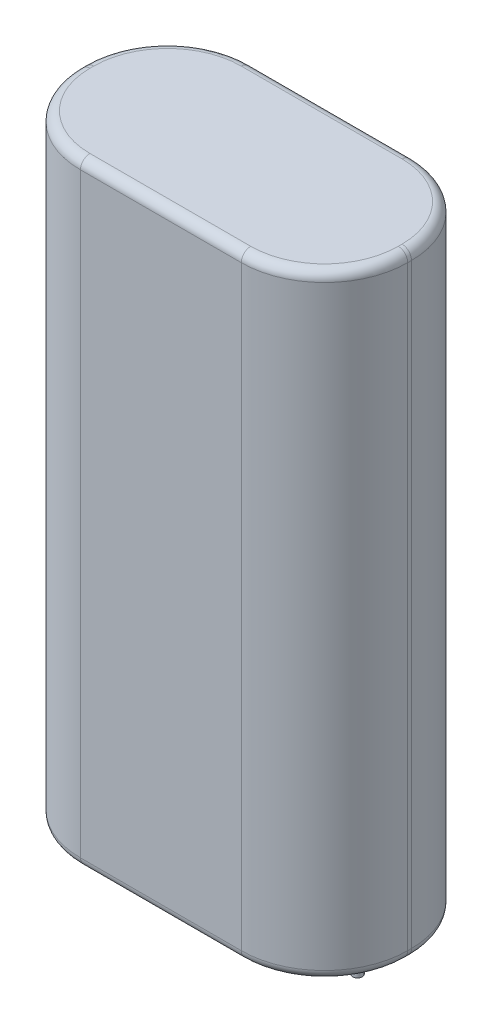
ISO-10303-21;
HEADER;
FILE_DESCRIPTION(('STEP AP214'),'2;1');
FILE_NAME('part.step','',(''),(''),'','','');
FILE_SCHEMA(('AUTOMOTIVE_DESIGN { 1 0 10303 214 1 1 1 1 }'));
ENDSEC;
DATA;
#1=APPLICATION_CONTEXT('core data for automotive mechanical design processes');
#2=APPLICATION_PROTOCOL_DEFINITION('international standard','automotive_design',2000,#1);
#3=PRODUCT_CONTEXT('',#1,'mechanical');
#4=PRODUCT('Part','Part','',(#3));
#5=PRODUCT_RELATED_PRODUCT_CATEGORY('part','',(#4));
#6=PRODUCT_DEFINITION_FORMATION('','',#4);
#7=PRODUCT_DEFINITION_CONTEXT('part definition',#1,'design');
#8=PRODUCT_DEFINITION('design','',#6,#7);
#9=PRODUCT_DEFINITION_SHAPE('','',#8);
#10=(LENGTH_UNIT() NAMED_UNIT(*) SI_UNIT(.MILLI.,.METRE.));
#11=(NAMED_UNIT(*) PLANE_ANGLE_UNIT() SI_UNIT($,.RADIAN.));
#12=(NAMED_UNIT(*) SI_UNIT($,.STERADIAN.) SOLID_ANGLE_UNIT());
#13=UNCERTAINTY_MEASURE_WITH_UNIT(LENGTH_MEASURE(1.E-05),#10,'distance_accuracy_value','');
#14=(GEOMETRIC_REPRESENTATION_CONTEXT(3) GLOBAL_UNCERTAINTY_ASSIGNED_CONTEXT((#13)) GLOBAL_UNIT_ASSIGNED_CONTEXT((#10,
#11,#12)) REPRESENTATION_CONTEXT('',''));
#15=CARTESIAN_POINT('',(0.,0.,0.));
#16=DIRECTION('',(0.,0.,1.));
#17=DIRECTION('',(1.,0.,0.));
#18=AXIS2_PLACEMENT_3D('',#15,#16,#17);
#19=CARTESIAN_POINT('',(5.9,-2.,0.));
#20=DIRECTION('',(0.,-1.,0.));
#21=DIRECTION('',(0.,0.,-1.));
#22=AXIS2_PLACEMENT_3D('',#19,#20,#21);
#23=PLANE('',#22);
#24=CARTESIAN_POINT('',(5.9,-2.,0.));
#25=DIRECTION('',(0.,1.,0.));
#26=DIRECTION('',(0.,0.,1.));
#27=AXIS2_PLACEMENT_3D('',#24,#25,#26);
#28=CIRCLE('',#27,0.25);
#29=CARTESIAN_POINT('',(5.9,-2.,0.25));
#30=VERTEX_POINT('',#29);
#31=EDGE_CURVE('E20',#30,#30,#28,.T.);
#32=ORIENTED_EDGE('',*,*,#31,.F.);
#33=EDGE_LOOP('',(#32));
#34=FACE_BOUND('',#33,.T.);
#35=ADVANCED_FACE('F17',(#34),#23,.T.);
#36=CARTESIAN_POINT('',(-5.9,-2.,0.));
#37=DIRECTION('',(0.,-1.,0.));
#38=DIRECTION('',(0.,0.,-1.));
#39=AXIS2_PLACEMENT_3D('',#36,#37,#38);
#40=PLANE('',#39);
#41=CARTESIAN_POINT('',(-5.9,-2.,0.));
#42=DIRECTION('',(0.,1.,0.));
#43=DIRECTION('',(0.,0.,1.));
#44=AXIS2_PLACEMENT_3D('',#41,#42,#43);
#45=CIRCLE('',#44,0.25);
#46=CARTESIAN_POINT('',(-5.9,-2.,0.25));
#47=VERTEX_POINT('',#46);
#48=EDGE_CURVE('E172',#47,#47,#45,.T.);
#49=ORIENTED_EDGE('',*,*,#48,.F.);
#50=EDGE_LOOP('',(#49));
#51=FACE_BOUND('',#50,.T.);
#52=ADVANCED_FACE('F647',(#51),#40,.T.);
#53=CARTESIAN_POINT('',(-4.25,32.5,-4.5));
#54=DIRECTION('',(0.,0.,1.));
#55=DIRECTION('',(1.,0.,0.));
#56=AXIS2_PLACEMENT_3D('',#53,#54,#55);
#57=PLANE('',#56);
#58=DIRECTION('',(-1.,0.,0.));
#59=VECTOR('',#58,1.);
#60=CARTESIAN_POINT('',(-4.25,0.500000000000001,-4.5));
#61=LINE('',#60,#59);
#62=CARTESIAN_POINT('',(-4.25,0.5,-4.5));
#63=VERTEX_POINT('',#62);
#64=CARTESIAN_POINT('',(4.25,0.5,-4.5));
#65=VERTEX_POINT('',#64);
#66=EDGE_CURVE('E182',#63,#65,#61,.F.);
#67=ORIENTED_EDGE('',*,*,#66,.F.);
#68=DIRECTION('',(0.,-1.,0.));
#69=VECTOR('',#68,1.);
#70=CARTESIAN_POINT('',(-4.25,32.5,-4.5));
#71=LINE('',#70,#69);
#72=CARTESIAN_POINT('',(-4.25,32.,-4.5));
#73=VERTEX_POINT('',#72);
#74=EDGE_CURVE('E157',#73,#63,#71,.T.);
#75=ORIENTED_EDGE('',*,*,#74,.F.);
#76=DIRECTION('',(1.,0.,0.));
#77=VECTOR('',#76,1.);
#78=CARTESIAN_POINT('',(4.25,32.,-4.5));
#79=LINE('',#78,#77);
#80=CARTESIAN_POINT('',(4.25,32.,-4.5));
#81=VERTEX_POINT('',#80);
#82=EDGE_CURVE('E131',#81,#73,#79,.F.);
#83=ORIENTED_EDGE('',*,*,#82,.F.);
#84=DIRECTION('',(0.,-1.,0.));
#85=VECTOR('',#84,1.);
#86=CARTESIAN_POINT('',(4.25,32.5,-4.5));
#87=LINE('',#86,#85);
#88=EDGE_CURVE('E145',#65,#81,#87,.F.);
#89=ORIENTED_EDGE('',*,*,#88,.F.);
#90=EDGE_LOOP('',(#67,#75,#83,#89));
#91=FACE_BOUND('',#90,.T.);
#92=ADVANCED_FACE('F155',(#91),#57,.F.);
#93=CARTESIAN_POINT('',(4.25,32.,-0.1));
#94=DIRECTION('',(0.,1.,0.));
#95=DIRECTION('',(0.,0.,1.));
#96=AXIS2_PLACEMENT_3D('',#93,#94,#95);
#97=TOROIDAL_SURFACE('',#96,3.9,0.5);
#98=CARTESIAN_POINT('',(4.25,32.,-4.));
#99=DIRECTION('',(1.,0.,0.));
#100=DIRECTION('',(0.,0.,-1.));
#101=AXIS2_PLACEMENT_3D('',#98,#99,#100);
#102=CIRCLE('',#101,0.5);
#103=CARTESIAN_POINT('',(4.25,32.5,-4.));
#104=VERTEX_POINT('',#103);
#105=EDGE_CURVE('E126',#104,#81,#102,.F.);
#106=ORIENTED_EDGE('',*,*,#105,.F.);
#107=CARTESIAN_POINT('',(4.25,32.5,-0.1));
#108=DIRECTION('',(0.,-1.,0.));
#109=DIRECTION('',(0.,0.,-1.));
#110=AXIS2_PLACEMENT_3D('',#107,#108,#109);
#111=CIRCLE('',#110,3.9);
#112=CARTESIAN_POINT('',(8.15,32.5,-0.100000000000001));
#113=VERTEX_POINT('',#112);
#114=EDGE_CURVE('E289',#113,#104,#111,.F.);
#115=ORIENTED_EDGE('',*,*,#114,.F.);
#116=CARTESIAN_POINT('',(8.15,32.,-0.100000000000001));
#117=DIRECTION('',(0.,0.,1.));
#118=DIRECTION('',(1.,0.,0.));
#119=AXIS2_PLACEMENT_3D('',#116,#117,#118);
#120=CIRCLE('',#119,0.5);
#121=CARTESIAN_POINT('',(8.65,32.,-0.100000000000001));
#122=VERTEX_POINT('',#121);
#123=EDGE_CURVE('E141',#122,#113,#120,.T.);
#124=ORIENTED_EDGE('',*,*,#123,.F.);
#125=CARTESIAN_POINT('',(4.25,32.,-0.1));
#126=DIRECTION('',(0.,-1.,0.));
#127=DIRECTION('',(0.,0.,-1.));
#128=AXIS2_PLACEMENT_3D('',#125,#126,#127);
#129=CIRCLE('',#128,4.4);
#130=EDGE_CURVE('E138',#81,#122,#129,.T.);
#131=ORIENTED_EDGE('',*,*,#130,.F.);
#132=EDGE_LOOP('',(#106,#115,#124,#131));
#133=FACE_BOUND('',#132,.T.);
#134=ADVANCED_FACE('F140',(#133),#97,.T.);
#135=CARTESIAN_POINT('',(4.25,32.,-4.));
#136=DIRECTION('',(1.,0.,0.));
#137=DIRECTION('',(0.,0.,-1.));
#138=AXIS2_PLACEMENT_3D('',#135,#136,#137);
#139=CYLINDRICAL_SURFACE('',#138,0.5);
#140=CARTESIAN_POINT('',(-4.25,32.,-4.));
#141=DIRECTION('',(-1.,0.,0.));
#142=DIRECTION('',(0.,0.,-1.));
#143=AXIS2_PLACEMENT_3D('',#140,#141,#142);
#144=CIRCLE('',#143,0.5);
#145=CARTESIAN_POINT('',(-4.25,32.5,-4.));
#146=VERTEX_POINT('',#145);
#147=EDGE_CURVE('E152',#146,#73,#144,.T.);
#148=ORIENTED_EDGE('',*,*,#147,.F.);
#149=DIRECTION('',(1.,0.,0.));
#150=VECTOR('',#149,1.);
#151=CARTESIAN_POINT('',(4.25,32.5,-4.));
#152=LINE('',#151,#150);
#153=EDGE_CURVE('E133',#104,#146,#152,.F.);
#154=ORIENTED_EDGE('',*,*,#153,.F.);
#155=ORIENTED_EDGE('',*,*,#105,.T.);
#156=ORIENTED_EDGE('',*,*,#82,.T.);
#157=EDGE_LOOP('',(#148,#154,#155,#156));
#158=FACE_BOUND('',#157,.T.);
#159=ADVANCED_FACE('F129',(#158),#139,.T.);
#160=CARTESIAN_POINT('',(-4.25,32.,-0.1));
#161=DIRECTION('',(0.,1.,0.));
#162=DIRECTION('',(0.,0.,1.));
#163=AXIS2_PLACEMENT_3D('',#160,#161,#162);
#164=TOROIDAL_SURFACE('',#163,3.9,0.5);
#165=CARTESIAN_POINT('',(-8.15,32.,-0.0999999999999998));
#166=DIRECTION('',(0.,0.,-1.));
#167=DIRECTION('',(-1.,0.,0.));
#168=AXIS2_PLACEMENT_3D('',#165,#166,#167);
#169=CIRCLE('',#168,0.5);
#170=CARTESIAN_POINT('',(-8.15,32.5,-0.1));
#171=VERTEX_POINT('',#170);
#172=CARTESIAN_POINT('',(-8.65,32.,-0.0999999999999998));
#173=VERTEX_POINT('',#172);
#174=EDGE_CURVE('E320',#171,#173,#169,.F.);
#175=ORIENTED_EDGE('',*,*,#174,.F.);
#176=CARTESIAN_POINT('',(-4.25,32.5,-0.1));
#177=DIRECTION('',(0.,-1.,0.));
#178=DIRECTION('',(-1.,0.,0.));
#179=AXIS2_PLACEMENT_3D('',#176,#177,#178);
#180=CIRCLE('',#179,3.9);
#181=EDGE_CURVE('E301',#146,#171,#180,.F.);
#182=ORIENTED_EDGE('',*,*,#181,.F.);
#183=ORIENTED_EDGE('',*,*,#147,.T.);
#184=CARTESIAN_POINT('',(-4.25,32.,-0.1));
#185=DIRECTION('',(0.,-1.,0.));
#186=DIRECTION('',(0.,0.,-1.));
#187=AXIS2_PLACEMENT_3D('',#184,#185,#186);
#188=CIRCLE('',#187,4.4);
#189=EDGE_CURVE('E698',#173,#73,#188,.T.);
#190=ORIENTED_EDGE('',*,*,#189,.F.);
#191=EDGE_LOOP('',(#175,#182,#183,#190));
#192=FACE_BOUND('',#191,.T.);
#193=ADVANCED_FACE('F621',(#192),#164,.T.);
#194=CARTESIAN_POINT('',(4.25,32.5,-0.1));
#195=DIRECTION('',(0.,-1.,0.));
#196=DIRECTION('',(0.,0.,-1.));
#197=AXIS2_PLACEMENT_3D('',#194,#195,#196);
#198=CYLINDRICAL_SURFACE('',#197,4.4);
#199=ORIENTED_EDGE('',*,*,#88,.T.);
#200=ORIENTED_EDGE('',*,*,#130,.T.);
#201=DIRECTION('',(0.,1.,0.));
#202=VECTOR('',#201,1.);
#203=CARTESIAN_POINT('',(8.65,32.5,-0.100000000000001));
#204=LINE('',#203,#202);
#205=CARTESIAN_POINT('',(8.65,0.5,-0.100000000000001));
#206=VERTEX_POINT('',#205);
#207=EDGE_CURVE('E684',#122,#206,#204,.F.);
#208=ORIENTED_EDGE('',*,*,#207,.T.);
#209=CARTESIAN_POINT('',(4.25,0.5,-0.1));
#210=DIRECTION('',(0.,1.,0.));
#211=DIRECTION('',(0.,0.,1.));
#212=AXIS2_PLACEMENT_3D('',#209,#210,#211);
#213=CIRCLE('',#212,4.4);
#214=EDGE_CURVE('E149',#65,#206,#213,.F.);
#215=ORIENTED_EDGE('',*,*,#214,.F.);
#216=EDGE_LOOP('',(#199,#200,#208,#215));
#217=FACE_BOUND('',#216,.T.);
#218=ADVANCED_FACE('F148',(#217),#198,.T.);
#219=CARTESIAN_POINT('',(8.15,32.,0.0999999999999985));
#220=DIRECTION('',(0.,0.,1.));
#221=DIRECTION('',(1.,0.,0.));
#222=AXIS2_PLACEMENT_3D('',#219,#220,#221);
#223=CYLINDRICAL_SURFACE('',#222,0.5);
#224=CARTESIAN_POINT('',(8.15,32.,0.0999999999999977));
#225=DIRECTION('',(0.,0.,-1.));
#226=DIRECTION('',(1.,0.,0.));
#227=AXIS2_PLACEMENT_3D('',#224,#225,#226);
#228=CIRCLE('',#227,0.5);
#229=CARTESIAN_POINT('',(8.65,32.,0.0999999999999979));
#230=VERTEX_POINT('',#229);
#231=CARTESIAN_POINT('',(8.15,32.5,0.0999999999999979));
#232=VERTEX_POINT('',#231);
#233=EDGE_CURVE('E690',#230,#232,#228,.F.);
#234=ORIENTED_EDGE('',*,*,#233,.F.);
#235=DIRECTION('',(0.,0.,1.));
#236=VECTOR('',#235,1.);
#237=CARTESIAN_POINT('',(8.65,32.,-0.100000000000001));
#238=LINE('',#237,#236);
#239=EDGE_CURVE('E688',#230,#122,#238,.F.);
#240=ORIENTED_EDGE('',*,*,#239,.T.);
#241=ORIENTED_EDGE('',*,*,#123,.T.);
#242=DIRECTION('',(0.,0.,1.));
#243=VECTOR('',#242,1.);
#244=CARTESIAN_POINT('',(8.15,32.5,0.0999999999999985));
#245=LINE('',#244,#243);
#246=EDGE_CURVE('E314',#232,#113,#245,.F.);
#247=ORIENTED_EDGE('',*,*,#246,.F.);
#248=EDGE_LOOP('',(#234,#240,#241,#247));
#249=FACE_BOUND('',#248,.T.);
#250=ADVANCED_FACE('F608',(#249),#223,.T.);
#251=CARTESIAN_POINT('',(8.15,0.5,-0.100000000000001));
#252=DIRECTION('',(0.,0.,-1.));
#253=DIRECTION('',(-1.,0.,0.));
#254=AXIS2_PLACEMENT_3D('',#251,#252,#253);
#255=CYLINDRICAL_SURFACE('',#254,0.5);
#256=CARTESIAN_POINT('',(8.15,0.5,0.0999999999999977));
#257=DIRECTION('',(0.,0.,-1.));
#258=DIRECTION('',(1.,0.,0.));
#259=AXIS2_PLACEMENT_3D('',#256,#257,#258);
#260=CIRCLE('',#259,0.5);
#261=CARTESIAN_POINT('',(8.15,0.,0.0999999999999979));
#262=VERTEX_POINT('',#261);
#263=CARTESIAN_POINT('',(8.65,0.5,0.099999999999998));
#264=VERTEX_POINT('',#263);
#265=EDGE_CURVE('E692',#262,#264,#260,.F.);
#266=ORIENTED_EDGE('',*,*,#265,.F.);
#267=DIRECTION('',(0.,0.,1.));
#268=VECTOR('',#267,1.);
#269=CARTESIAN_POINT('',(8.15,0.,0.0999999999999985));
#270=LINE('',#269,#268);
#271=CARTESIAN_POINT('',(8.15,0.,-0.100000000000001));
#272=VERTEX_POINT('',#271);
#273=EDGE_CURVE('E445',#262,#272,#270,.F.);
#274=ORIENTED_EDGE('',*,*,#273,.T.);
#275=CARTESIAN_POINT('',(8.15,0.5,-0.100000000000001));
#276=DIRECTION('',(0.,0.,-1.));
#277=DIRECTION('',(1.,0.,0.));
#278=AXIS2_PLACEMENT_3D('',#275,#276,#277);
#279=CIRCLE('',#278,0.5);
#280=EDGE_CURVE('E219',#206,#272,#279,.T.);
#281=ORIENTED_EDGE('',*,*,#280,.F.);
#282=DIRECTION('',(0.,0.,1.));
#283=VECTOR('',#282,1.);
#284=CARTESIAN_POINT('',(8.65,0.5,-0.100000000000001));
#285=LINE('',#284,#283);
#286=EDGE_CURVE('E687',#206,#264,#285,.T.);
#287=ORIENTED_EDGE('',*,*,#286,.T.);
#288=EDGE_LOOP('',(#266,#274,#281,#287));
#289=FACE_BOUND('',#288,.T.);
#290=ADVANCED_FACE('F213',(#289),#255,.T.);
#291=CARTESIAN_POINT('',(4.25,0.5,-0.1));
#292=DIRECTION('',(0.,1.,0.));
#293=DIRECTION('',(0.,0.,1.));
#294=AXIS2_PLACEMENT_3D('',#291,#292,#293);
#295=TOROIDAL_SURFACE('',#294,3.9,0.5);
#296=CARTESIAN_POINT('',(4.25,0.5,-4.));
#297=DIRECTION('',(-1.,0.,0.));
#298=DIRECTION('',(0.,0.,1.));
#299=AXIS2_PLACEMENT_3D('',#296,#297,#298);
#300=CIRCLE('',#299,0.5);
#301=CARTESIAN_POINT('',(4.25,0.,-4.));
#302=VERTEX_POINT('',#301);
#303=EDGE_CURVE('E189',#65,#302,#300,.T.);
#304=ORIENTED_EDGE('',*,*,#303,.F.);
#305=ORIENTED_EDGE('',*,*,#214,.T.);
#306=ORIENTED_EDGE('',*,*,#280,.T.);
#307=CARTESIAN_POINT('',(4.25,0.,-0.1));
#308=DIRECTION('',(0.,1.,0.));
#309=DIRECTION('',(1.,0.,0.));
#310=AXIS2_PLACEMENT_3D('',#307,#308,#309);
#311=CIRCLE('',#310,3.9);
#312=EDGE_CURVE('E442',#272,#302,#311,.T.);
#313=ORIENTED_EDGE('',*,*,#312,.T.);
#314=EDGE_LOOP('',(#304,#305,#306,#313));
#315=FACE_BOUND('',#314,.T.);
#316=ADVANCED_FACE('F207',(#315),#295,.T.);
#317=CARTESIAN_POINT('',(-4.25,0.5,-4.));
#318=DIRECTION('',(-1.,0.,0.));
#319=DIRECTION('',(0.,0.,1.));
#320=AXIS2_PLACEMENT_3D('',#317,#318,#319);
#321=CYLINDRICAL_SURFACE('',#320,0.5);
#322=CARTESIAN_POINT('',(-4.25,0.5,-4.));
#323=DIRECTION('',(-1.,0.,0.));
#324=DIRECTION('',(0.,0.,-1.));
#325=AXIS2_PLACEMENT_3D('',#322,#323,#324);
#326=CIRCLE('',#325,0.5);
#327=CARTESIAN_POINT('',(-4.25,0.,-4.));
#328=VERTEX_POINT('',#327);
#329=EDGE_CURVE('E179',#63,#328,#326,.T.);
#330=ORIENTED_EDGE('',*,*,#329,.F.);
#331=ORIENTED_EDGE('',*,*,#66,.T.);
#332=ORIENTED_EDGE('',*,*,#303,.T.);
#333=DIRECTION('',(1.,0.,0.));
#334=VECTOR('',#333,1.);
#335=CARTESIAN_POINT('',(4.25,0.,-4.));
#336=LINE('',#335,#334);
#337=EDGE_CURVE('E439',#302,#328,#336,.F.);
#338=ORIENTED_EDGE('',*,*,#337,.T.);
#339=EDGE_LOOP('',(#330,#331,#332,#338));
#340=FACE_BOUND('',#339,.T.);
#341=ADVANCED_FACE('F212',(#340),#321,.T.);
#342=CARTESIAN_POINT('',(-4.25,0.5,-0.1));
#343=DIRECTION('',(0.,1.,0.));
#344=DIRECTION('',(0.,0.,1.));
#345=AXIS2_PLACEMENT_3D('',#342,#343,#344);
#346=TOROIDAL_SURFACE('',#345,3.9,0.5);
#347=CARTESIAN_POINT('',(-8.15,0.5,-0.0999999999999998));
#348=DIRECTION('',(0.,0.,1.));
#349=DIRECTION('',(1.,0.,0.));
#350=AXIS2_PLACEMENT_3D('',#347,#348,#349);
#351=CIRCLE('',#350,0.5);
#352=CARTESIAN_POINT('',(-8.65,0.5,-0.0999999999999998));
#353=VERTEX_POINT('',#352);
#354=CARTESIAN_POINT('',(-8.15,0.,-0.1));
#355=VERTEX_POINT('',#354);
#356=EDGE_CURVE('E701',#353,#355,#351,.T.);
#357=ORIENTED_EDGE('',*,*,#356,.F.);
#358=CARTESIAN_POINT('',(-4.25,0.5,-0.1));
#359=DIRECTION('',(0.,-1.,0.));
#360=DIRECTION('',(0.,0.,-1.));
#361=AXIS2_PLACEMENT_3D('',#358,#359,#360);
#362=CIRCLE('',#361,4.4);
#363=EDGE_CURVE('E176',#63,#353,#362,.F.);
#364=ORIENTED_EDGE('',*,*,#363,.F.);
#365=ORIENTED_EDGE('',*,*,#329,.T.);
#366=CARTESIAN_POINT('',(-4.25,0.,-0.1));
#367=DIRECTION('',(0.,1.,0.));
#368=DIRECTION('',(0.,0.,-1.));
#369=AXIS2_PLACEMENT_3D('',#366,#367,#368);
#370=CIRCLE('',#369,3.9);
#371=EDGE_CURVE('E436',#328,#355,#370,.T.);
#372=ORIENTED_EDGE('',*,*,#371,.T.);
#373=EDGE_LOOP('',(#357,#364,#365,#372));
#374=FACE_BOUND('',#373,.T.);
#375=ADVANCED_FACE('F586',(#374),#346,.T.);
#376=CARTESIAN_POINT('',(5.9,-2.,0.));
#377=DIRECTION('',(0.,1.,0.));
#378=DIRECTION('',(0.,0.,1.));
#379=AXIS2_PLACEMENT_3D('',#376,#377,#378);
#380=CYLINDRICAL_SURFACE('',#379,0.25);
#381=ORIENTED_EDGE('',*,*,#31,.T.);
#382=EDGE_LOOP('',(#381));
#383=FACE_BOUND('',#382,.T.);
#384=CARTESIAN_POINT('',(5.9,0.,0.));
#385=DIRECTION('',(0.,1.,0.));
#386=DIRECTION('',(0.,0.,1.));
#387=AXIS2_PLACEMENT_3D('',#384,#385,#386);
#388=CIRCLE('',#387,0.25);
#389=CARTESIAN_POINT('',(5.9,0.,0.25));
#390=VERTEX_POINT('',#389);
#391=EDGE_CURVE('E169',#390,#390,#388,.F.);
#392=ORIENTED_EDGE('',*,*,#391,.T.);
#393=EDGE_LOOP('',(#392));
#394=FACE_BOUND('',#393,.T.);
#395=ADVANCED_FACE('F579',(#383,#394),#380,.T.);
#396=CARTESIAN_POINT('',(-5.9,-2.,0.));
#397=DIRECTION('',(0.,1.,0.));
#398=DIRECTION('',(0.,0.,1.));
#399=AXIS2_PLACEMENT_3D('',#396,#397,#398);
#400=CYLINDRICAL_SURFACE('',#399,0.25);
#401=ORIENTED_EDGE('',*,*,#48,.T.);
#402=EDGE_LOOP('',(#401));
#403=FACE_BOUND('',#402,.T.);
#404=CARTESIAN_POINT('',(-5.9,0.,0.));
#405=DIRECTION('',(0.,1.,0.));
#406=DIRECTION('',(0.,0.,1.));
#407=AXIS2_PLACEMENT_3D('',#404,#405,#406);
#408=CIRCLE('',#407,0.25);
#409=CARTESIAN_POINT('',(-5.9,0.,0.25));
#410=VERTEX_POINT('',#409);
#411=EDGE_CURVE('E165',#410,#410,#408,.F.);
#412=ORIENTED_EDGE('',*,*,#411,.T.);
#413=EDGE_LOOP('',(#412));
#414=FACE_BOUND('',#413,.T.);
#415=ADVANCED_FACE('F571',(#403,#414),#400,.T.);
#416=CARTESIAN_POINT('',(-4.25,32.5,-0.1));
#417=DIRECTION('',(0.,-1.,0.));
#418=DIRECTION('',(0.,0.,-1.));
#419=AXIS2_PLACEMENT_3D('',#416,#417,#418);
#420=CYLINDRICAL_SURFACE('',#419,4.4);
#421=DIRECTION('',(0.,1.,0.));
#422=VECTOR('',#421,1.);
#423=CARTESIAN_POINT('',(-8.65,32.5,-0.0999999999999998));
#424=LINE('',#423,#422);
#425=EDGE_CURVE('E700',#353,#173,#424,.T.);
#426=ORIENTED_EDGE('',*,*,#425,.T.);
#427=ORIENTED_EDGE('',*,*,#189,.T.);
#428=ORIENTED_EDGE('',*,*,#74,.T.);
#429=ORIENTED_EDGE('',*,*,#363,.T.);
#430=EDGE_LOOP('',(#426,#427,#428,#429));
#431=FACE_BOUND('',#430,.T.);
#432=ADVANCED_FACE('F563',(#431),#420,.T.);
#433=CARTESIAN_POINT('',(-8.15,0.5,-0.0999999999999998));
#434=DIRECTION('',(0.,0.,1.));
#435=DIRECTION('',(1.,0.,0.));
#436=AXIS2_PLACEMENT_3D('',#433,#434,#435);
#437=CYLINDRICAL_SURFACE('',#436,0.5);
#438=CARTESIAN_POINT('',(-8.15,0.5,0.0999999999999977));
#439=DIRECTION('',(0.,0.,1.));
#440=DIRECTION('',(-1.,0.,0.));
#441=AXIS2_PLACEMENT_3D('',#438,#439,#440);
#442=CIRCLE('',#441,0.5);
#443=CARTESIAN_POINT('',(-8.65,0.5,0.0999999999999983));
#444=VERTEX_POINT('',#443);
#445=CARTESIAN_POINT('',(-8.15,0.,0.0999999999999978));
#446=VERTEX_POINT('',#445);
#447=EDGE_CURVE('E718',#444,#446,#442,.T.);
#448=ORIENTED_EDGE('',*,*,#447,.F.);
#449=DIRECTION('',(0.,0.,-1.));
#450=VECTOR('',#449,1.);
#451=CARTESIAN_POINT('',(-8.65,0.5,-0.0999999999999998));
#452=LINE('',#451,#450);
#453=EDGE_CURVE('E716',#444,#353,#452,.T.);
#454=ORIENTED_EDGE('',*,*,#453,.T.);
#455=ORIENTED_EDGE('',*,*,#356,.T.);
#456=DIRECTION('',(0.,0.,1.));
#457=VECTOR('',#456,1.);
#458=CARTESIAN_POINT('',(-8.15,0.,0.0999999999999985));
#459=LINE('',#458,#457);
#460=EDGE_CURVE('E171',#355,#446,#459,.T.);
#461=ORIENTED_EDGE('',*,*,#460,.T.);
#462=EDGE_LOOP('',(#448,#454,#455,#461));
#463=FACE_BOUND('',#462,.T.);
#464=ADVANCED_FACE('F493',(#463),#437,.T.);
#465=CARTESIAN_POINT('',(-8.15,32.,0.0999999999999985));
#466=DIRECTION('',(0.,0.,-1.));
#467=DIRECTION('',(-1.,0.,0.));
#468=AXIS2_PLACEMENT_3D('',#465,#466,#467);
#469=CYLINDRICAL_SURFACE('',#468,0.5);
#470=CARTESIAN_POINT('',(-8.15,32.,0.0999999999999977));
#471=DIRECTION('',(0.,0.,1.));
#472=DIRECTION('',(-1.,0.,0.));
#473=AXIS2_PLACEMENT_3D('',#470,#471,#472);
#474=CIRCLE('',#473,0.5);
#475=CARTESIAN_POINT('',(-8.15,32.5,0.0999999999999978));
#476=VERTEX_POINT('',#475);
#477=CARTESIAN_POINT('',(-8.65,32.,0.099999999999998));
#478=VERTEX_POINT('',#477);
#479=EDGE_CURVE('E362',#476,#478,#474,.T.);
#480=ORIENTED_EDGE('',*,*,#479,.F.);
#481=DIRECTION('',(0.,0.,1.));
#482=VECTOR('',#481,1.);
#483=CARTESIAN_POINT('',(-8.15,32.5,0.0999999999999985));
#484=LINE('',#483,#482);
#485=EDGE_CURVE('E316',#171,#476,#484,.T.);
#486=ORIENTED_EDGE('',*,*,#485,.F.);
#487=ORIENTED_EDGE('',*,*,#174,.T.);
#488=DIRECTION('',(0.,0.,-1.));
#489=VECTOR('',#488,1.);
#490=CARTESIAN_POINT('',(-8.65,32.,-0.0999999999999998));
#491=LINE('',#490,#489);
#492=EDGE_CURVE('E168',#173,#478,#491,.F.);
#493=ORIENTED_EDGE('',*,*,#492,.T.);
#494=EDGE_LOOP('',(#480,#486,#487,#493));
#495=FACE_BOUND('',#494,.T.);
#496=ADVANCED_FACE('F488',(#495),#469,.T.);
#497=CARTESIAN_POINT('',(4.25,32.5,0.0999999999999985));
#498=DIRECTION('',(0.,1.,0.));
#499=DIRECTION('',(0.,0.,1.));
#500=AXIS2_PLACEMENT_3D('',#497,#498,#499);
#501=PLANE('',#500);
#502=ORIENTED_EDGE('',*,*,#153,.T.);
#503=ORIENTED_EDGE('',*,*,#181,.T.);
#504=ORIENTED_EDGE('',*,*,#485,.T.);
#505=CARTESIAN_POINT('',(-4.25,32.5,0.0999999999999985));
#506=DIRECTION('',(0.,-1.,0.));
#507=DIRECTION('',(0.,0.,1.));
#508=AXIS2_PLACEMENT_3D('',#505,#506,#507);
#509=CIRCLE('',#508,3.9);
#510=CARTESIAN_POINT('',(-4.25,32.5,4.));
#511=VERTEX_POINT('',#510);
#512=EDGE_CURVE('E265',#511,#476,#509,.T.);
#513=ORIENTED_EDGE('',*,*,#512,.F.);
#514=DIRECTION('',(-1.,0.,0.));
#515=VECTOR('',#514,1.);
#516=CARTESIAN_POINT('',(4.25,32.5,4.));
#517=LINE('',#516,#515);
#518=CARTESIAN_POINT('',(4.25,32.5,4.));
#519=VERTEX_POINT('',#518);
#520=EDGE_CURVE('E326',#519,#511,#517,.T.);
#521=ORIENTED_EDGE('',*,*,#520,.F.);
#522=CARTESIAN_POINT('',(4.25,32.5,0.0999999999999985));
#523=DIRECTION('',(0.,-1.,0.));
#524=DIRECTION('',(1.,0.,0.));
#525=AXIS2_PLACEMENT_3D('',#522,#523,#524);
#526=CIRCLE('',#525,3.9);
#527=EDGE_CURVE('E278',#232,#519,#526,.T.);
#528=ORIENTED_EDGE('',*,*,#527,.F.);
#529=ORIENTED_EDGE('',*,*,#246,.T.);
#530=ORIENTED_EDGE('',*,*,#114,.T.);
#531=EDGE_LOOP('',(#502,#503,#504,#513,#521,#528,#529,#530));
#532=FACE_BOUND('',#531,.T.);
#533=ADVANCED_FACE('F251',(#532),#501,.T.);
#534=CARTESIAN_POINT('',(4.25,0.5,0.0999999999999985));
#535=DIRECTION('',(0.,1.,0.));
#536=DIRECTION('',(0.,0.,1.));
#537=AXIS2_PLACEMENT_3D('',#534,#535,#536);
#538=TOROIDAL_SURFACE('',#537,3.9,0.5);
#539=CARTESIAN_POINT('',(4.25,0.5,4.));
#540=DIRECTION('',(1.,0.,0.));
#541=DIRECTION('',(0.,0.,1.));
#542=AXIS2_PLACEMENT_3D('',#539,#540,#541);
#543=CIRCLE('',#542,0.5);
#544=CARTESIAN_POINT('',(4.25,0.5,4.5));
#545=VERTEX_POINT('',#544);
#546=CARTESIAN_POINT('',(4.25,0.,4.));
#547=VERTEX_POINT('',#546);
#548=EDGE_CURVE('E237',#545,#547,#543,.T.);
#549=ORIENTED_EDGE('',*,*,#548,.T.);
#550=CARTESIAN_POINT('',(4.25,0.,0.0999999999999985));
#551=DIRECTION('',(0.,1.,0.));
#552=DIRECTION('',(0.,0.,1.));
#553=AXIS2_PLACEMENT_3D('',#550,#551,#552);
#554=CIRCLE('',#553,3.9);
#555=EDGE_CURVE('E232',#547,#262,#554,.T.);
#556=ORIENTED_EDGE('',*,*,#555,.T.);
#557=ORIENTED_EDGE('',*,*,#265,.T.);
#558=CARTESIAN_POINT('',(4.25,0.5,0.0999999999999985));
#559=DIRECTION('',(0.,-1.,0.));
#560=DIRECTION('',(0.,0.,-1.));
#561=AXIS2_PLACEMENT_3D('',#558,#559,#560);
#562=CIRCLE('',#561,4.4);
#563=EDGE_CURVE('E335',#545,#264,#562,.F.);
#564=ORIENTED_EDGE('',*,*,#563,.F.);
#565=EDGE_LOOP('',(#549,#556,#557,#564));
#566=FACE_BOUND('',#565,.T.);
#567=ADVANCED_FACE('F239',(#566),#538,.T.);
#568=CARTESIAN_POINT('',(8.65,32.5,-0.100000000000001));
#569=DIRECTION('',(-1.,0.,0.));
#570=DIRECTION('',(0.,0.,1.));
#571=AXIS2_PLACEMENT_3D('',#568,#569,#570);
#572=PLANE('',#571);
#573=ORIENTED_EDGE('',*,*,#286,.F.);
#574=ORIENTED_EDGE('',*,*,#207,.F.);
#575=ORIENTED_EDGE('',*,*,#239,.F.);
#576=DIRECTION('',(0.,-1.,0.));
#577=VECTOR('',#576,1.);
#578=CARTESIAN_POINT('',(8.65,32.5,0.0999999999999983));
#579=LINE('',#578,#577);
#580=EDGE_CURVE('E341',#264,#230,#579,.F.);
#581=ORIENTED_EDGE('',*,*,#580,.F.);
#582=EDGE_LOOP('',(#573,#574,#575,#581));
#583=FACE_BOUND('',#582,.T.);
#584=ADVANCED_FACE('F250',(#583),#572,.F.);
#585=CARTESIAN_POINT('',(4.25,32.,0.0999999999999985));
#586=DIRECTION('',(0.,1.,0.));
#587=DIRECTION('',(0.,0.,1.));
#588=AXIS2_PLACEMENT_3D('',#585,#586,#587);
#589=TOROIDAL_SURFACE('',#588,3.9,0.5);
#590=CARTESIAN_POINT('',(4.25,32.,4.));
#591=DIRECTION('',(-1.,0.,0.));
#592=DIRECTION('',(0.,0.,1.));
#593=AXIS2_PLACEMENT_3D('',#590,#591,#592);
#594=CIRCLE('',#593,0.5);
#595=CARTESIAN_POINT('',(4.25,32.,4.5));
#596=VERTEX_POINT('',#595);
#597=EDGE_CURVE('E323',#596,#519,#594,.T.);
#598=ORIENTED_EDGE('',*,*,#597,.F.);
#599=CARTESIAN_POINT('',(4.25,32.,0.0999999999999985));
#600=DIRECTION('',(0.,-1.,0.));
#601=DIRECTION('',(0.,0.,-1.));
#602=AXIS2_PLACEMENT_3D('',#599,#600,#601);
#603=CIRCLE('',#602,4.4);
#604=EDGE_CURVE('E338',#230,#596,#603,.T.);
#605=ORIENTED_EDGE('',*,*,#604,.F.);
#606=ORIENTED_EDGE('',*,*,#233,.T.);
#607=ORIENTED_EDGE('',*,*,#527,.T.);
#608=EDGE_LOOP('',(#598,#605,#606,#607));
#609=FACE_BOUND('',#608,.T.);
#610=ADVANCED_FACE('F404',(#609),#589,.T.);
#611=CARTESIAN_POINT('',(4.25,0.,0.0999999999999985));
#612=DIRECTION('',(0.,1.,0.));
#613=DIRECTION('',(0.,0.,1.));
#614=AXIS2_PLACEMENT_3D('',#611,#612,#613);
#615=PLANE('',#614);
#616=ORIENTED_EDGE('',*,*,#411,.F.);
#617=EDGE_LOOP('',(#616));
#618=FACE_BOUND('',#617,.T.);
#619=ORIENTED_EDGE('',*,*,#391,.F.);
#620=EDGE_LOOP('',(#619));
#621=FACE_BOUND('',#620,.T.);
#622=CARTESIAN_POINT('',(-4.25,0.,0.0999999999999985));
#623=DIRECTION('',(0.,1.,0.));
#624=DIRECTION('',(-1.,0.,0.));
#625=AXIS2_PLACEMENT_3D('',#622,#623,#624);
#626=CIRCLE('',#625,3.9);
#627=CARTESIAN_POINT('',(-4.25,0.,4.));
#628=VERTEX_POINT('',#627);
#629=EDGE_CURVE('E425',#446,#628,#626,.T.);
#630=ORIENTED_EDGE('',*,*,#629,.F.);
#631=ORIENTED_EDGE('',*,*,#460,.F.);
#632=ORIENTED_EDGE('',*,*,#371,.F.);
#633=ORIENTED_EDGE('',*,*,#337,.F.);
#634=ORIENTED_EDGE('',*,*,#312,.F.);
#635=ORIENTED_EDGE('',*,*,#273,.F.);
#636=ORIENTED_EDGE('',*,*,#555,.F.);
#637=DIRECTION('',(1.,0.,0.));
#638=VECTOR('',#637,1.);
#639=CARTESIAN_POINT('',(-4.25,0.,4.));
#640=LINE('',#639,#638);
#641=EDGE_CURVE('E452',#628,#547,#640,.T.);
#642=ORIENTED_EDGE('',*,*,#641,.F.);
#643=EDGE_LOOP('',(#630,#631,#632,#633,#634,#635,#636,#642));
#644=FACE_BOUND('',#643,.T.);
#645=ADVANCED_FACE('F395',(#618,#621,#644),#615,.F.);
#646=CARTESIAN_POINT('',(-8.65,32.5,-0.0999999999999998));
#647=DIRECTION('',(1.,0.,0.));
#648=DIRECTION('',(0.,0.,-1.));
#649=AXIS2_PLACEMENT_3D('',#646,#647,#648);
#650=PLANE('',#649);
#651=ORIENTED_EDGE('',*,*,#453,.F.);
#652=DIRECTION('',(0.,-1.,0.));
#653=VECTOR('',#652,1.);
#654=CARTESIAN_POINT('',(-8.65,32.5,0.0999999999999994));
#655=LINE('',#654,#653);
#656=EDGE_CURVE('E456',#478,#444,#655,.T.);
#657=ORIENTED_EDGE('',*,*,#656,.F.);
#658=ORIENTED_EDGE('',*,*,#492,.F.);
#659=ORIENTED_EDGE('',*,*,#425,.F.);
#660=EDGE_LOOP('',(#651,#657,#658,#659));
#661=FACE_BOUND('',#660,.T.);
#662=ADVANCED_FACE('F403',(#661),#650,.F.);
#663=CARTESIAN_POINT('',(-4.25,0.5,0.0999999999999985));
#664=DIRECTION('',(0.,1.,0.));
#665=DIRECTION('',(0.,0.,1.));
#666=AXIS2_PLACEMENT_3D('',#663,#664,#665);
#667=TOROIDAL_SURFACE('',#666,3.9,0.5);
#668=CARTESIAN_POINT('',(-4.25,0.5,4.));
#669=DIRECTION('',(1.,0.,0.));
#670=DIRECTION('',(0.,0.,-1.));
#671=AXIS2_PLACEMENT_3D('',#668,#669,#670);
#672=CIRCLE('',#671,0.5);
#673=CARTESIAN_POINT('',(-4.25,0.5,4.5));
#674=VERTEX_POINT('',#673);
#675=EDGE_CURVE('E340',#674,#628,#672,.T.);
#676=ORIENTED_EDGE('',*,*,#675,.F.);
#677=CARTESIAN_POINT('',(-4.25,0.5,0.0999999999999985));
#678=DIRECTION('',(0.,-1.,0.));
#679=DIRECTION('',(0.,0.,-1.));
#680=AXIS2_PLACEMENT_3D('',#677,#678,#679);
#681=CIRCLE('',#680,4.4);
#682=EDGE_CURVE('E34',#444,#674,#681,.F.);
#683=ORIENTED_EDGE('',*,*,#682,.F.);
#684=ORIENTED_EDGE('',*,*,#447,.T.);
#685=ORIENTED_EDGE('',*,*,#629,.T.);
#686=EDGE_LOOP('',(#676,#683,#684,#685));
#687=FACE_BOUND('',#686,.T.);
#688=ADVANCED_FACE('F376',(#687),#667,.T.);
#689=CARTESIAN_POINT('',(-4.25,32.,0.0999999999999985));
#690=DIRECTION('',(0.,1.,0.));
#691=DIRECTION('',(0.,0.,1.));
#692=AXIS2_PLACEMENT_3D('',#689,#690,#691);
#693=TOROIDAL_SURFACE('',#692,3.9,0.5);
#694=CARTESIAN_POINT('',(-4.25,32.,4.));
#695=DIRECTION('',(-1.,0.,0.));
#696=DIRECTION('',(0.,0.,1.));
#697=AXIS2_PLACEMENT_3D('',#694,#695,#696);
#698=CIRCLE('',#697,0.5);
#699=CARTESIAN_POINT('',(-4.25,32.,4.5));
#700=VERTEX_POINT('',#699);
#701=EDGE_CURVE('E330',#511,#700,#698,.F.);
#702=ORIENTED_EDGE('',*,*,#701,.F.);
#703=ORIENTED_EDGE('',*,*,#512,.T.);
#704=ORIENTED_EDGE('',*,*,#479,.T.);
#705=CARTESIAN_POINT('',(-4.25,32.,0.0999999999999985));
#706=DIRECTION('',(0.,-1.,0.));
#707=DIRECTION('',(0.,0.,-1.));
#708=AXIS2_PLACEMENT_3D('',#705,#706,#707);
#709=CIRCLE('',#708,4.4);
#710=EDGE_CURVE('E352',#700,#478,#709,.T.);
#711=ORIENTED_EDGE('',*,*,#710,.F.);
#712=EDGE_LOOP('',(#702,#703,#704,#711));
#713=FACE_BOUND('',#712,.T.);
#714=ADVANCED_FACE('F364',(#713),#693,.T.);
#715=CARTESIAN_POINT('',(4.25,32.,4.));
#716=DIRECTION('',(-1.,0.,0.));
#717=DIRECTION('',(0.,0.,1.));
#718=AXIS2_PLACEMENT_3D('',#715,#716,#717);
#719=CYLINDRICAL_SURFACE('',#718,0.5);
#720=ORIENTED_EDGE('',*,*,#701,.T.);
#721=DIRECTION('',(-1.,0.,0.));
#722=VECTOR('',#721,1.);
#723=CARTESIAN_POINT('',(-4.25,32.,4.5));
#724=LINE('',#723,#722);
#725=EDGE_CURVE('E347',#700,#596,#724,.F.);
#726=ORIENTED_EDGE('',*,*,#725,.T.);
#727=ORIENTED_EDGE('',*,*,#597,.T.);
#728=ORIENTED_EDGE('',*,*,#520,.T.);
#729=EDGE_LOOP('',(#720,#726,#727,#728));
#730=FACE_BOUND('',#729,.T.);
#731=ADVANCED_FACE('F375',(#730),#719,.T.);
#732=CARTESIAN_POINT('',(4.25,32.5,0.0999999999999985));
#733=DIRECTION('',(0.,-1.,0.));
#734=DIRECTION('',(0.,0.,-1.));
#735=AXIS2_PLACEMENT_3D('',#732,#733,#734);
#736=CYLINDRICAL_SURFACE('',#735,4.4);
#737=ORIENTED_EDGE('',*,*,#580,.T.);
#738=ORIENTED_EDGE('',*,*,#604,.T.);
#739=DIRECTION('',(0.,1.,0.));
#740=VECTOR('',#739,1.);
#741=CARTESIAN_POINT('',(4.25,32.5,4.5));
#742=LINE('',#741,#740);
#743=EDGE_CURVE('E344',#596,#545,#742,.F.);
#744=ORIENTED_EDGE('',*,*,#743,.T.);
#745=ORIENTED_EDGE('',*,*,#563,.T.);
#746=EDGE_LOOP('',(#737,#738,#744,#745));
#747=FACE_BOUND('',#746,.T.);
#748=ADVANCED_FACE('F478',(#747),#736,.T.);
#749=CARTESIAN_POINT('',(-4.25,0.5,4.));
#750=DIRECTION('',(1.,0.,0.));
#751=DIRECTION('',(0.,0.,-1.));
#752=AXIS2_PLACEMENT_3D('',#749,#750,#751);
#753=CYLINDRICAL_SURFACE('',#752,0.5);
#754=ORIENTED_EDGE('',*,*,#675,.T.);
#755=ORIENTED_EDGE('',*,*,#641,.T.);
#756=ORIENTED_EDGE('',*,*,#548,.F.);
#757=DIRECTION('',(-1.,0.,0.));
#758=VECTOR('',#757,1.);
#759=CARTESIAN_POINT('',(-4.25,0.5,4.5));
#760=LINE('',#759,#758);
#761=EDGE_CURVE('E26',#545,#674,#760,.T.);
#762=ORIENTED_EDGE('',*,*,#761,.T.);
#763=EDGE_LOOP('',(#754,#755,#756,#762));
#764=FACE_BOUND('',#763,.T.);
#765=ADVANCED_FACE('F468',(#764),#753,.T.);
#766=CARTESIAN_POINT('',(-4.25,32.5,0.0999999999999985));
#767=DIRECTION('',(0.,-1.,0.));
#768=DIRECTION('',(0.,0.,-1.));
#769=AXIS2_PLACEMENT_3D('',#766,#767,#768);
#770=CYLINDRICAL_SURFACE('',#769,4.4);
#771=DIRECTION('',(0.,1.,0.));
#772=VECTOR('',#771,1.);
#773=CARTESIAN_POINT('',(-4.25,32.5,4.5));
#774=LINE('',#773,#772);
#775=EDGE_CURVE('E11',#674,#700,#774,.T.);
#776=ORIENTED_EDGE('',*,*,#775,.T.);
#777=ORIENTED_EDGE('',*,*,#710,.T.);
#778=ORIENTED_EDGE('',*,*,#656,.T.);
#779=ORIENTED_EDGE('',*,*,#682,.T.);
#780=EDGE_LOOP('',(#776,#777,#778,#779));
#781=FACE_BOUND('',#780,.T.);
#782=ADVANCED_FACE('F496',(#781),#770,.T.);
#783=CARTESIAN_POINT('',(-4.25,32.5,4.5));
#784=DIRECTION('',(0.,0.,-1.));
#785=DIRECTION('',(-1.,0.,0.));
#786=AXIS2_PLACEMENT_3D('',#783,#784,#785);
#787=PLANE('',#786);
#788=ORIENTED_EDGE('',*,*,#761,.F.);
#789=ORIENTED_EDGE('',*,*,#743,.F.);
#790=ORIENTED_EDGE('',*,*,#725,.F.);
#791=ORIENTED_EDGE('',*,*,#775,.F.);
#792=EDGE_LOOP('',(#788,#789,#790,#791));
#793=FACE_BOUND('',#792,.T.);
#794=ADVANCED_FACE('F473',(#793),#787,.F.);
#795=CLOSED_SHELL('',(#35,#52,#92,#134,#159,#193,#218,#250,#290,#316,#341,#375,#395,#415,#432,
#464,#496,#533,#567,#584,#610,#645,#662,#688,#714,#731,#748,#765,#782,#794));
#796=MANIFOLD_SOLID_BREP('B1',#795);
#797=ADVANCED_BREP_SHAPE_REPRESENTATION('',(#18,#796),#14);
#798=SHAPE_DEFINITION_REPRESENTATION(#9,#797);
ENDSEC;
END-ISO-10303-21;
